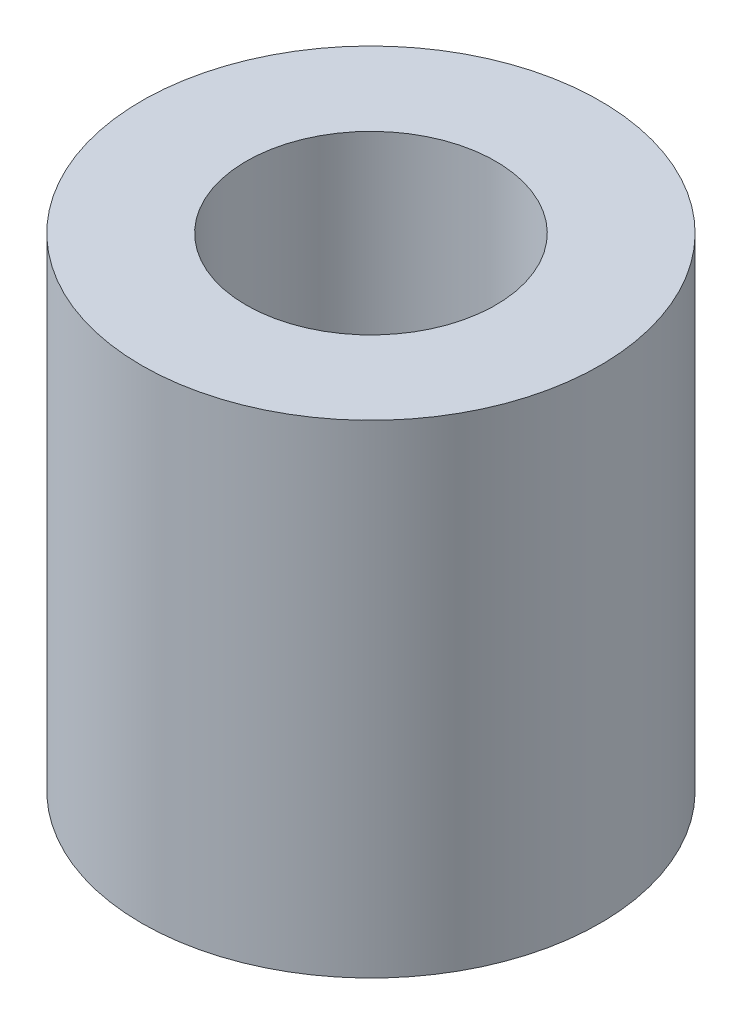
ISO-10303-21;
HEADER;
FILE_DESCRIPTION(('STEP AP214'),'2;1');
FILE_NAME('part.step','',(''),(''),'','','');
FILE_SCHEMA(('AUTOMOTIVE_DESIGN { 1 0 10303 214 1 1 1 1 }'));
ENDSEC;
DATA;
#1=APPLICATION_CONTEXT('core data for automotive mechanical design processes');
#2=APPLICATION_PROTOCOL_DEFINITION('international standard','automotive_design',2000,#1);
#3=PRODUCT_CONTEXT('',#1,'mechanical');
#4=PRODUCT('Part','Part','',(#3));
#5=PRODUCT_RELATED_PRODUCT_CATEGORY('part','',(#4));
#6=PRODUCT_DEFINITION_FORMATION('','',#4);
#7=PRODUCT_DEFINITION_CONTEXT('part definition',#1,'design');
#8=PRODUCT_DEFINITION('design','',#6,#7);
#9=PRODUCT_DEFINITION_SHAPE('','',#8);
#10=(LENGTH_UNIT() NAMED_UNIT(*) SI_UNIT(.MILLI.,.METRE.));
#11=(NAMED_UNIT(*) PLANE_ANGLE_UNIT() SI_UNIT($,.RADIAN.));
#12=(NAMED_UNIT(*) SI_UNIT($,.STERADIAN.) SOLID_ANGLE_UNIT());
#13=UNCERTAINTY_MEASURE_WITH_UNIT(LENGTH_MEASURE(1.E-05),#10,'distance_accuracy_value','');
#14=(GEOMETRIC_REPRESENTATION_CONTEXT(3) GLOBAL_UNCERTAINTY_ASSIGNED_CONTEXT((#13)) GLOBAL_UNIT_ASSIGNED_CONTEXT((#10,
#11,#12)) REPRESENTATION_CONTEXT('',''));
#15=CARTESIAN_POINT('',(0.,0.,0.));
#16=DIRECTION('',(0.,0.,1.));
#17=DIRECTION('',(1.,0.,0.));
#18=AXIS2_PLACEMENT_3D('',#15,#16,#17);
#19=CARTESIAN_POINT('',(0.,-7.14375,0.));
#20=DIRECTION('',(0.,1.,0.));
#21=DIRECTION('',(0.,0.,1.));
#22=AXIS2_PLACEMENT_3D('',#19,#20,#21);
#23=CYLINDRICAL_SURFACE('',#22,3.175);
#24=CARTESIAN_POINT('',(0.,-6.69017857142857,0.));
#25=DIRECTION('',(0.,1.,0.));
#26=DIRECTION('',(0.,0.,1.));
#27=AXIS2_PLACEMENT_3D('',#24,#25,#26);
#28=CIRCLE('',#27,3.175);
#29=CARTESIAN_POINT('',(0.,-6.69017857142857,3.175));
#30=VERTEX_POINT('',#29);
#31=EDGE_CURVE('E42',#30,#30,#28,.T.);
#32=ORIENTED_EDGE('',*,*,#31,.T.);
#33=EDGE_LOOP('',(#32));
#34=FACE_BOUND('',#33,.T.);
#35=CARTESIAN_POINT('',(0.,0.,0.));
#36=DIRECTION('',(0.,1.,0.));
#37=DIRECTION('',(0.,0.,1.));
#38=AXIS2_PLACEMENT_3D('',#35,#36,#37);
#39=CIRCLE('',#38,3.175);
#40=CARTESIAN_POINT('',(0.,0.,3.175));
#41=VERTEX_POINT('',#40);
#42=EDGE_CURVE('E46',#41,#41,#39,.T.);
#43=ORIENTED_EDGE('',*,*,#42,.F.);
#44=EDGE_LOOP('',(#43));
#45=FACE_BOUND('',#44,.T.);
#46=ADVANCED_FACE('F36',(#34,#45),#23,.T.);
#47=CARTESIAN_POINT('',(0.,-7.14375,0.));
#48=DIRECTION('',(0.,1.,0.));
#49=DIRECTION('',(0.,0.,1.));
#50=AXIS2_PLACEMENT_3D('',#47,#48,#49);
#51=PLANE('',#50);
#52=CARTESIAN_POINT('',(0.,-7.14375,0.));
#53=DIRECTION('',(0.,1.,0.));
#54=DIRECTION('',(0.,0.,1.));
#55=AXIS2_PLACEMENT_3D('',#52,#53,#54);
#56=CIRCLE('',#55,1.7272);
#57=CARTESIAN_POINT('',(0.,-7.14375,1.7272));
#58=VERTEX_POINT('',#57);
#59=EDGE_CURVE('E55',#58,#58,#56,.T.);
#60=ORIENTED_EDGE('',*,*,#59,.T.);
#61=EDGE_LOOP('',(#60));
#62=FACE_BOUND('',#61,.T.);
#63=CARTESIAN_POINT('',(0.,-7.14375,0.));
#64=DIRECTION('',(0.,1.,0.));
#65=DIRECTION('',(0.,0.,1.));
#66=AXIS2_PLACEMENT_3D('',#63,#64,#65);
#67=CIRCLE('',#66,2.38939124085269);
#68=CARTESIAN_POINT('',(0.,-7.14375,2.38939124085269));
#69=VERTEX_POINT('',#68);
#70=EDGE_CURVE('E10',#69,#69,#67,.F.);
#71=ORIENTED_EDGE('',*,*,#70,.T.);
#72=EDGE_LOOP('',(#71));
#73=FACE_BOUND('',#72,.T.);
#74=ADVANCED_FACE('F59',(#62,#73),#51,.F.);
#75=CARTESIAN_POINT('',(0.,0.,0.));
#76=DIRECTION('',(0.,1.,0.));
#77=DIRECTION('',(0.,0.,1.));
#78=AXIS2_PLACEMENT_3D('',#75,#76,#77);
#79=PLANE('',#78);
#80=CARTESIAN_POINT('',(0.,0.,0.));
#81=DIRECTION('',(0.,1.,0.));
#82=DIRECTION('',(0.,0.,1.));
#83=AXIS2_PLACEMENT_3D('',#80,#81,#82);
#84=CIRCLE('',#83,1.72719999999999);
#85=CARTESIAN_POINT('',(0.,0.,1.72719999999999));
#86=VERTEX_POINT('',#85);
#87=EDGE_CURVE('E50',#86,#86,#84,.T.);
#88=ORIENTED_EDGE('',*,*,#87,.F.);
#89=EDGE_LOOP('',(#88));
#90=FACE_BOUND('',#89,.T.);
#91=ORIENTED_EDGE('',*,*,#42,.T.);
#92=EDGE_LOOP('',(#91));
#93=FACE_BOUND('',#92,.T.);
#94=ADVANCED_FACE('F68',(#90,#93),#79,.T.);
#95=CARTESIAN_POINT('',(0.,-6.69017857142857,0.));
#96=DIRECTION('',(0.,1.,0.));
#97=DIRECTION('',(0.,0.,1.));
#98=AXIS2_PLACEMENT_3D('',#95,#96,#97);
#99=CONICAL_SURFACE('',#98,3.175,1.04719755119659);
#100=ORIENTED_EDGE('',*,*,#70,.F.);
#101=EDGE_LOOP('',(#100));
#102=FACE_BOUND('',#101,.T.);
#103=ORIENTED_EDGE('',*,*,#31,.F.);
#104=EDGE_LOOP('',(#103));
#105=FACE_BOUND('',#104,.T.);
#106=ADVANCED_FACE('F64',(#102,#105),#99,.T.);
#107=CARTESIAN_POINT('',(0.,0.,0.));
#108=DIRECTION('',(0.,1.,0.));
#109=DIRECTION('',(0.,0.,1.));
#110=AXIS2_PLACEMENT_3D('',#107,#108,#109);
#111=CYLINDRICAL_SURFACE('',#110,1.72719999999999);
#112=ORIENTED_EDGE('',*,*,#59,.F.);
#113=EDGE_LOOP('',(#112));
#114=FACE_BOUND('',#113,.T.);
#115=ORIENTED_EDGE('',*,*,#87,.T.);
#116=EDGE_LOOP('',(#115));
#117=FACE_BOUND('',#116,.T.);
#118=ADVANCED_FACE('F61',(#114,#117),#111,.F.);
#119=CLOSED_SHELL('',(#46,#74,#94,#106,#118));
#120=MANIFOLD_SOLID_BREP('B2',#119);
#121=ADVANCED_BREP_SHAPE_REPRESENTATION('',(#18,#120),#14);
#122=SHAPE_DEFINITION_REPRESENTATION(#9,#121);
ENDSEC;
END-ISO-10303-21;
